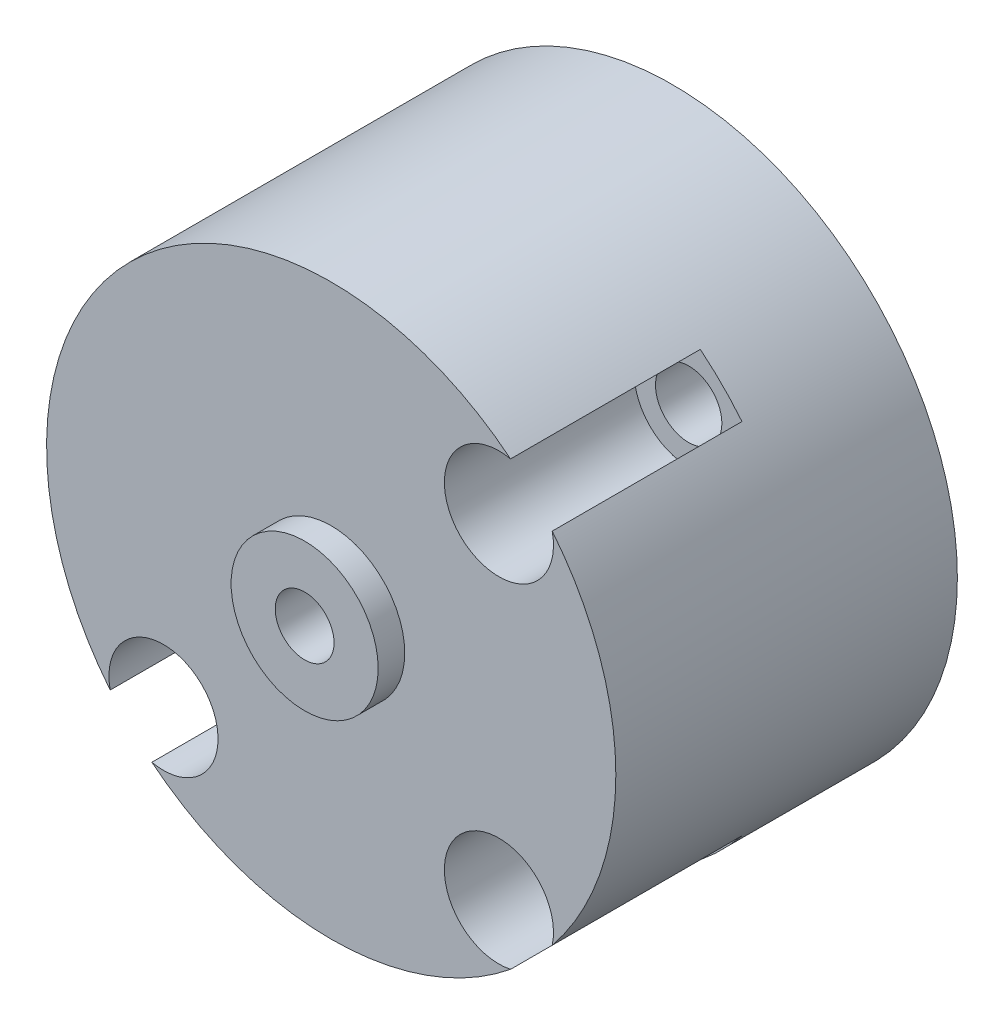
from build123d import *

# Parameters (mm, degrees)
CROQUIS1_R                   = 15
CROQUIS1_R_2                 = 1.75
SALIENTE_EXTRUIR1_DEPTH      = 5
SALIENTE_EXTRUIR2_DEPTH      = 13
SALIENTE_EXTRUIR2_DEPTH_BACK = 3
CROQUIS2_R                   = 15
CROQUIS2_R_2                 = 1.55
CROQUIS3_R                   = 3.875
CROQUIS3_R_2                 = 1.55
SALIENTE_EXTRUIR3_DEPTH      = 1.4
CROQUIS5_R                   = 2.875
CORTAR_EXTRUIR1_DEPTH        = 10
CROQUIS6_R                   = 4
CORTAR_EXTRUIR2_DEPTH        = 12
CORTAR_EXTRUIR3_DEPTH        = 3.3
CROQUIS8_R                   = 1.75
CORTAR_EXTRUIR4_DEPTH        = 175.773529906


with BuildPart() as part:
    # Croquis1 → Saliente-Extruir1 (new body)
    with BuildSketch(Plane.XY):
        with Locations((0, 158.044580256)):
            Circle(CROQUIS1_R)
        with Locations((8.838834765, 149.205745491)):
            Circle(CROQUIS1_R_2, mode=Mode.SUBTRACT)
        with Locations((8.838834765, 166.88341502)):
            Circle(CROQUIS1_R_2, mode=Mode.SUBTRACT)
        with Locations((-8.838834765, 149.205745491)):
            Circle(CROQUIS1_R_2, mode=Mode.SUBTRACT)
        with Locations((0, 158.044580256)):
            Circle(CROQUIS1_R_2, mode=Mode.SUBTRACT)
    extrude(amount=SALIENTE_EXTRUIR1_DEPTH)

    # Croquis2 → Saliente-Extruir2 (add, two sides: drawn at the far end of the back side and taken through both)
    with BuildSketch(Plane.XY.offset(5).offset(-SALIENTE_EXTRUIR2_DEPTH_BACK)):
        with Locations((0, 158.044580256)):
            Circle(CROQUIS2_R)
        with Locations((0, 158.044580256)):
            Circle(CROQUIS2_R_2, mode=Mode.SUBTRACT)
        with Locations((8.838834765, 166.88341502)):
            Circle(CROQUIS2_R_2, mode=Mode.SUBTRACT)
        with Locations((8.838834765, 149.205745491)):
            Circle(CROQUIS2_R_2, mode=Mode.SUBTRACT)
        with Locations((-8.838834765, 149.205745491)):
            Circle(CROQUIS2_R_2, mode=Mode.SUBTRACT)
    extrude(amount=SALIENTE_EXTRUIR2_DEPTH + SALIENTE_EXTRUIR2_DEPTH_BACK)

    # Croquis3 → Saliente-Extruir3 (add)
    with BuildSketch(Plane.XY.offset(18)):
        with Locations((0, 158.044580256)):
            Circle(CROQUIS3_R)
        with Locations((0, 158.044580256)):
            Circle(CROQUIS3_R_2, mode=Mode.SUBTRACT)
    extrude(amount=SALIENTE_EXTRUIR3_DEPTH)

    # Croquis5 → Cortar-Extruir1 (cut)
    with BuildSketch(Plane.XY.offset(18)):
        with Locations((8.838834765, 166.88341502)):
            Circle(CROQUIS5_R)
        with Locations((8.838834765, 149.205745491)):
            Circle(CROQUIS5_R)
        with Locations((-8.838834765, 149.205745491)):
            Circle(CROQUIS5_R)
    extrude(amount=-CORTAR_EXTRUIR1_DEPTH, mode=Mode.SUBTRACT)

    # Croquis6 → Cortar-Extruir2 (cut)
    with BuildSketch(Plane(origin=(0, 0, 0), x_dir=(-1, 0, 0), z_dir=(0, 0, -1))):
        with Locations((0, 158.044580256)):
            Circle(CROQUIS6_R)
    extrude(amount=-CORTAR_EXTRUIR2_DEPTH, mode=Mode.SUBTRACT)

    # Croquis7 → Cortar-Extruir3 (cut)
    with BuildSketch(Plane(origin=(0, 0, 12), x_dir=(-1, 0, 0), z_dir=(0, 0, -1))):
        Polygon((2.650281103, 160.701522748), (-0.975839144, 161.668262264), (-3.626120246, 159.011319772), (-2.650281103, 155.387637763), (0.975839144, 154.420898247), (3.626120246, 157.07784074), align=None)
    extrude(amount=-CORTAR_EXTRUIR3_DEPTH, mode=Mode.SUBTRACT)

    # Croquis8 → Cortar-Extruir4 (cut, through all)
    with BuildSketch(Plane(origin=(0, 0, 0), x_dir=(-1, 0, 0), z_dir=(0, 0, -1))):
        with Locations(Location((-8.838834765, 149.205745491, 0), (0, 0, 180))):
            Circle(CROQUIS8_R)
        with Locations(Location((8.838834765, 149.205745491, 0), (0, 0, 180))):
            Circle(CROQUIS8_R)
        with Locations(Location((-8.838834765, 166.88341502, 0), (0, 0, 180))):
            Circle(CROQUIS8_R)
    extrude(amount=-CORTAR_EXTRUIR4_DEPTH, mode=Mode.SUBTRACT)


solid = part.part
